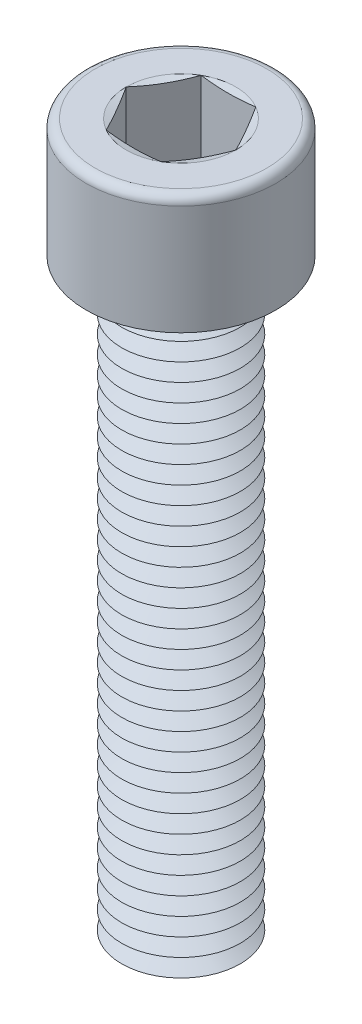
from build123d import *

# Parameters (mm, degrees)
SKETCH1_R       = 5
EXTRUDE1_DEPTH  = 50
SKETCH2_R       = 8
EXTRUDE2_DEPTH  = 10
EXTRUDE3_DEPTH  = 8
FILLET1_R       = 0.75
LPATTERN1_COUNT = 33
LPATTERN1_PITCH = 1.5


with BuildPart() as part:
    # Sketch1 → Extrude1 (new body)
    with BuildSketch(Plane(origin=(0, 0, 0), x_dir=(1, 0, 0), z_dir=(0, 1, 0))):
        with Locations(Location((0, 0, 0), (0, 0, 270))):
            Circle(SKETCH1_R)
    extrude(amount=EXTRUDE1_DEPTH)

    # Sketch2 → Extrude2 (add)
    with BuildSketch(Plane(origin=(0, 50, 0), x_dir=(1, 0, 0), z_dir=(0, 1, 0))):
        with Locations(Location((0, 0, 0), (0, 0, 270))):
            Circle(SKETCH2_R)
    extrude(amount=EXTRUDE2_DEPTH)

    # Sketch3 → Extrude3 (cut)
    with BuildSketch(Plane(origin=(0, 60, 0), x_dir=(1, 0, 0), z_dir=(0, 1, 0))):
        Polygon((2.309401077, 4), (-2.309401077, 4), (-4.618802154, 0), (-2.309401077, -4), (2.309401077, -4), (4.618802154, 0), align=None)
    extrude(amount=-EXTRUDE3_DEPTH, mode=Mode.SUBTRACT)

    # Fillet1
    fillet1_edges = [part.edges().sort_by_distance(p)[0] for p in [
        (0, 60, -8),
    ]]
    fillet(fillet1_edges, radius=FILLET1_R)

    # Sketch4 → Cut-Revolve1 (revolve, cut)
    with BuildSketch(Plane(origin=(0, 0, 0), x_dir=(0, 0, -1), z_dir=(1, 0, 0))):
        Polygon((-4, 52), (0, 52), (0, 49.690598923), align=None)
    revolve(axis=Axis((0, 52, 0), (0, -1, 0)), mode=Mode.SUBTRACT)

    # Sketch5 → Cut-Revolve2 (revolve, cut)
    with BuildSketch(Plane.XY, mode=Mode.PRIVATE) as cut_revolve2_sk:
        Polygon((-5, 0.75), (-5, -0.75), (-3.700961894, 0), align=None)
    cut_revolve2 = revolve(cut_revolve2_sk.sketch.rotate(Axis((0, 50, 0), (0, -1, 0)), 270), axis=Axis((0, 50, 0), (0, -1, 0)), mode=Mode.SUBTRACT)

    # LPattern1: Cut-Revolve2 ×33
    with Locations(*[(0, i * LPATTERN1_PITCH, 0) for i in range(1, LPATTERN1_COUNT)]):
        add(cut_revolve2, mode=Mode.SUBTRACT)

    # Extrude4 cone 1 section (on through the dimple's axis) → Extrude4 (revolve, cut)
    with BuildSketch(Plane(origin=(0, 60, 0), x_dir=(0, 0, 1), z_dir=(1, 0, 0))):
        Polygon((0, 0), (4.618802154, 0), (0, 1.237604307), align=None)
    revolve(axis=Axis((0, 60, 0), (0, -1, 0)), mode=Mode.SUBTRACT)


solid = part.part
